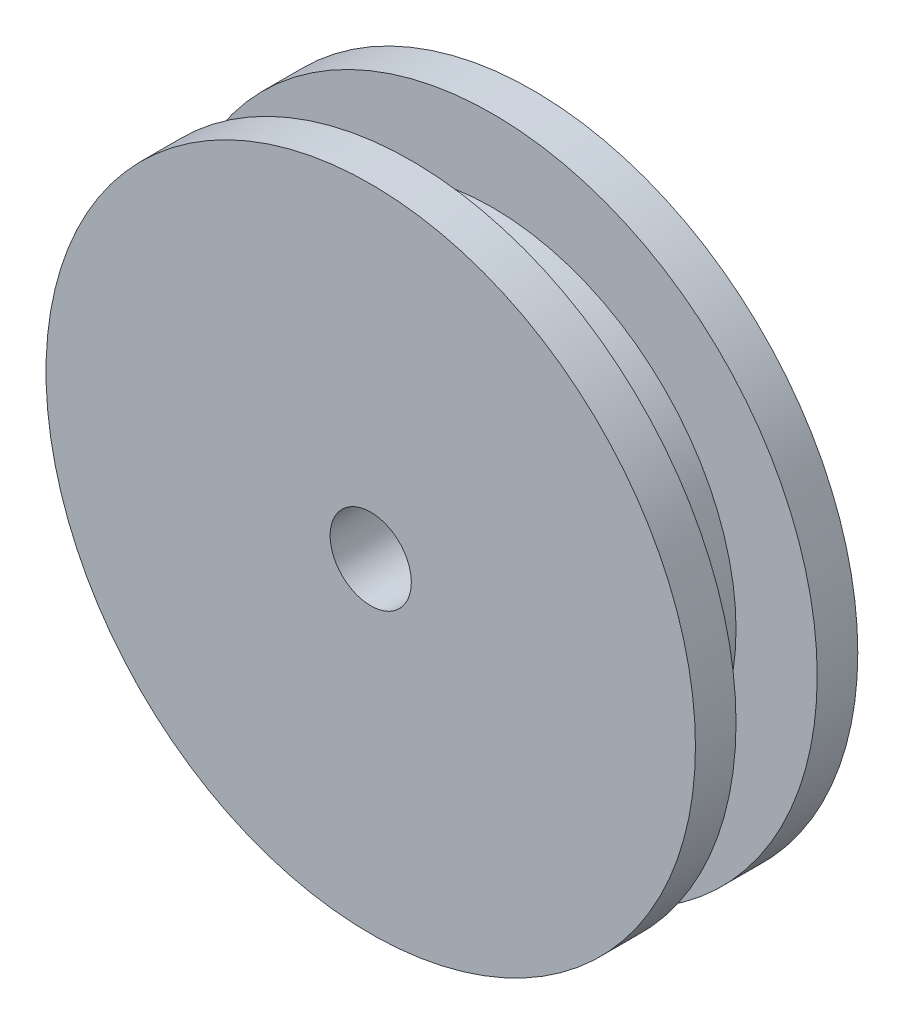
ISO-10303-21;
HEADER;
FILE_DESCRIPTION(('STEP AP214'),'2;1');
FILE_NAME('part.step','',(''),(''),'','','');
FILE_SCHEMA(('AUTOMOTIVE_DESIGN { 1 0 10303 214 1 1 1 1 }'));
ENDSEC;
DATA;
#1=APPLICATION_CONTEXT('core data for automotive mechanical design processes');
#2=APPLICATION_PROTOCOL_DEFINITION('international standard','automotive_design',2000,#1);
#3=PRODUCT_CONTEXT('',#1,'mechanical');
#4=PRODUCT('Part','Part','',(#3));
#5=PRODUCT_RELATED_PRODUCT_CATEGORY('part','',(#4));
#6=PRODUCT_DEFINITION_FORMATION('','',#4);
#7=PRODUCT_DEFINITION_CONTEXT('part definition',#1,'design');
#8=PRODUCT_DEFINITION('design','',#6,#7);
#9=PRODUCT_DEFINITION_SHAPE('','',#8);
#10=(LENGTH_UNIT() NAMED_UNIT(*) SI_UNIT(.MILLI.,.METRE.));
#11=(NAMED_UNIT(*) PLANE_ANGLE_UNIT() SI_UNIT($,.RADIAN.));
#12=(NAMED_UNIT(*) SI_UNIT($,.STERADIAN.) SOLID_ANGLE_UNIT());
#13=UNCERTAINTY_MEASURE_WITH_UNIT(LENGTH_MEASURE(1.E-05),#10,'distance_accuracy_value','');
#14=(GEOMETRIC_REPRESENTATION_CONTEXT(3) GLOBAL_UNCERTAINTY_ASSIGNED_CONTEXT((#13)) GLOBAL_UNIT_ASSIGNED_CONTEXT((#10,
#11,#12)) REPRESENTATION_CONTEXT('',''));
#15=CARTESIAN_POINT('',(0.,0.,0.));
#16=DIRECTION('',(0.,0.,1.));
#17=DIRECTION('',(1.,0.,0.));
#18=AXIS2_PLACEMENT_3D('',#15,#16,#17);
#19=CARTESIAN_POINT('',(0.,0.,6.35));
#20=DIRECTION('',(0.,0.,1.));
#21=DIRECTION('',(1.,0.,0.));
#22=AXIS2_PLACEMENT_3D('',#19,#20,#21);
#23=CYLINDRICAL_SURFACE('',#22,6.35);
#24=CARTESIAN_POINT('',(0.,0.,-6.35));
#25=DIRECTION('',(0.,0.,1.));
#26=DIRECTION('',(1.,0.,0.));
#27=AXIS2_PLACEMENT_3D('',#24,#25,#26);
#28=CIRCLE('',#27,6.35);
#29=CARTESIAN_POINT('',(6.35,0.,-6.35));
#30=VERTEX_POINT('',#29);
#31=EDGE_CURVE('E46',#30,#30,#28,.T.);
#32=ORIENTED_EDGE('',*,*,#31,.F.);
#33=EDGE_LOOP('',(#32));
#34=FACE_BOUND('',#33,.T.);
#35=CARTESIAN_POINT('',(0.,0.,-11.1125));
#36=DIRECTION('',(0.,0.,1.));
#37=DIRECTION('',(1.,0.,0.));
#38=AXIS2_PLACEMENT_3D('',#35,#36,#37);
#39=CIRCLE('',#38,6.35);
#40=CARTESIAN_POINT('',(6.35,0.,-11.1125));
#41=VERTEX_POINT('',#40);
#42=EDGE_CURVE('E10',#41,#41,#39,.T.);
#43=ORIENTED_EDGE('',*,*,#42,.T.);
#44=EDGE_LOOP('',(#43));
#45=FACE_BOUND('',#44,.T.);
#46=CARTESIAN_POINT('',(0.,6.35,-9.7234375));
#47=CARTESIAN_POINT('',(-0.0553700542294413,6.34999908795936,-9.72343523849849));
#48=CARTESIAN_POINT('',(-0.110771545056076,6.34926821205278,-9.71878687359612));
#49=CARTESIAN_POINT('',(-0.220024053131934,6.34642295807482,-9.70032203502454));
#50=CARTESIAN_POINT('',(-0.273873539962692,6.34430726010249,-9.68649681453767));
#51=CARTESIAN_POINT('',(-0.378425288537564,6.33892995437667,-9.65010307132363));
#52=CARTESIAN_POINT('',(-0.429129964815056,6.33566923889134,-9.62754135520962));
#53=CARTESIAN_POINT('',(-0.526026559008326,6.32836155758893,-9.57433213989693));
#54=CARTESIAN_POINT('',(-0.572219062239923,6.32431469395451,-9.54368569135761));
#55=CARTESIAN_POINT('',(-0.659177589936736,6.31584600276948,-9.47490125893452));
#56=CARTESIAN_POINT('',(-0.699899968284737,6.31142157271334,-9.43670841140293));
#57=CARTESIAN_POINT('',(-0.77438555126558,6.30271661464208,-9.35403341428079));
#58=CARTESIAN_POINT('',(-0.808148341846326,6.29843609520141,-9.30955089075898));
#59=CARTESIAN_POINT('',(-0.867928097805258,6.2904783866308,-9.21526356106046));
#60=CARTESIAN_POINT('',(-0.89390249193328,6.2868045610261,-9.16543145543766));
#61=CARTESIAN_POINT('',(-0.937096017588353,6.28051195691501,-9.06204475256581));
#62=CARTESIAN_POINT('',(-0.954315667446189,6.27789311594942,-9.00849037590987));
#63=CARTESIAN_POINT('',(-0.979374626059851,6.27403270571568,-8.89963973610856));
#64=CARTESIAN_POINT('',(-0.987288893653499,6.27278013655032,-8.84436112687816));
#65=CARTESIAN_POINT('',(-0.993744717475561,6.27176074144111,-8.73324739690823));
#66=CARTESIAN_POINT('',(-0.992286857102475,6.27199382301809,-8.67741231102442));
#67=CARTESIAN_POINT('',(-0.980100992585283,6.2739093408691,-8.56730211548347));
#68=CARTESIAN_POINT('',(-0.969456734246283,6.27557868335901,-8.51301747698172));
#69=CARTESIAN_POINT('',(-0.939331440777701,6.2801581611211,-8.40701423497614));
#70=CARTESIAN_POINT('',(-0.919850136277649,6.28306833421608,-8.35529570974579));
#71=CARTESIAN_POINT('',(-0.872517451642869,6.28981591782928,-8.25563947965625));
#72=CARTESIAN_POINT('',(-0.844630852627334,6.293657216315,-8.20771877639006));
#73=CARTESIAN_POINT('',(-0.781304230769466,6.3018314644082,-8.1172051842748));
#74=CARTESIAN_POINT('',(-0.745863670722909,6.30616444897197,-8.07461267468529));
#75=CARTESIAN_POINT('',(-0.667976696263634,6.31489158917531,-7.9954793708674));
#76=CARTESIAN_POINT('',(-0.62545833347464,6.31928589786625,-7.95900937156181));
#77=CARTESIAN_POINT('',(-0.534867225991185,6.32759690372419,-7.89371153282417));
#78=CARTESIAN_POINT('',(-0.486794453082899,6.33151359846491,-7.86488373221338));
#79=CARTESIAN_POINT('',(-0.386395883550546,6.33843267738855,-7.81568395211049));
#80=CARTESIAN_POINT('',(-0.334067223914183,6.3414344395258,-7.79531772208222));
#81=CARTESIAN_POINT('',(-0.226674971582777,6.34618031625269,-7.76368225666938));
#82=CARTESIAN_POINT('',(-0.171611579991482,6.34792452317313,-7.75241235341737));
#83=CARTESIAN_POINT('',(-0.0609236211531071,6.34994646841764,-7.73938425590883));
#84=CARTESIAN_POINT('',(-0.00531076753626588,6.35023920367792,-7.73752878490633));
#85=CARTESIAN_POINT('',(0.105431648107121,6.34936613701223,-7.74312360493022));
#86=CARTESIAN_POINT('',(0.160561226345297,6.34820038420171,-7.75057358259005));
#87=CARTESIAN_POINT('',(0.268475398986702,6.34455060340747,-7.77448692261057));
#88=CARTESIAN_POINT('',(0.321270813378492,6.34207354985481,-7.79090261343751));
#89=CARTESIAN_POINT('',(0.423360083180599,6.33607792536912,-7.83223092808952));
#90=CARTESIAN_POINT('',(0.472653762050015,6.33255930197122,-7.85714397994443));
#91=CARTESIAN_POINT('',(0.566766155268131,6.32483404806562,-7.91498607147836));
#92=CARTESIAN_POINT('',(0.611546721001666,6.32062223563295,-7.94797647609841));
#93=CARTESIAN_POINT('',(0.694970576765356,6.31199477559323,-8.02095173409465));
#94=CARTESIAN_POINT('',(0.733613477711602,6.30757911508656,-8.06093703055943));
#95=CARTESIAN_POINT('',(0.804021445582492,6.29899373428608,-8.14720128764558));
#96=CARTESIAN_POINT('',(0.835721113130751,6.294826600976,-8.19353392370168));
#97=CARTESIAN_POINT('',(0.890887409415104,6.28725681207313,-8.29092356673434));
#98=CARTESIAN_POINT('',(0.914354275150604,6.2838541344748,-8.34198043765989));
#99=CARTESIAN_POINT('',(0.952288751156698,6.27821750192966,-8.44717863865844));
#100=CARTESIAN_POINT('',(0.966790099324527,6.27597917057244,-8.50130755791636));
#101=CARTESIAN_POINT('',(0.986488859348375,6.2729132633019,-8.61127037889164));
#102=CARTESIAN_POINT('',(0.991686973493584,6.27208558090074,-8.66710415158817));
#103=CARTESIAN_POINT('',(0.992613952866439,6.27193888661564,-8.77823949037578));
#104=CARTESIAN_POINT('',(0.988445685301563,6.27260348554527,-8.83354020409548));
#105=CARTESIAN_POINT('',(0.970979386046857,6.27533074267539,-8.94264360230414));
#106=CARTESIAN_POINT('',(0.957681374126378,6.27739339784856,-8.99644629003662));
#107=CARTESIAN_POINT('',(0.922370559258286,6.28267844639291,-9.10099376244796));
#108=CARTESIAN_POINT('',(0.900365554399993,6.28589980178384,-9.15174123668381));
#109=CARTESIAN_POINT('',(0.848275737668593,6.2931404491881,-9.24884072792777));
#110=CARTESIAN_POINT('',(0.818190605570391,6.29715977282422,-9.29519257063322));
#111=CARTESIAN_POINT('',(0.750423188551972,6.30559591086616,-9.38270663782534));
#112=CARTESIAN_POINT('',(0.712664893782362,6.3100164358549,-9.42380965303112));
#113=CARTESIAN_POINT('',(0.630783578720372,6.31872642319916,-9.49913217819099));
#114=CARTESIAN_POINT('',(0.586659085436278,6.32301585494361,-9.53335009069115));
#115=CARTESIAN_POINT('',(0.49298497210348,6.33100993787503,-9.59411626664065));
#116=CARTESIAN_POINT('',(0.443404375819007,6.33471092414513,-9.62061725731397));
#117=CARTESIAN_POINT('',(0.340459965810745,6.34107531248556,-9.66487502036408));
#118=CARTESIAN_POINT('',(0.287100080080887,6.34373977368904,-9.68264072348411));
#119=CARTESIAN_POINT('',(0.194593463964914,6.34713236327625,-9.70495623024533));
#120=CARTESIAN_POINT('',(0.156013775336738,6.34820212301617,-9.71187593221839));
#121=CARTESIAN_POINT('',(0.0782946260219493,6.34963625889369,-9.72111733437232));
#122=CARTESIAN_POINT('',(0.0391551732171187,6.35000064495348,-9.72343909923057));
#123=CARTESIAN_POINT('',(0.,6.35,-9.7234375));
#124=B_SPLINE_CURVE_WITH_KNOTS('',3,(#46,#47,#48,#49,#50,#51,#52,#53,#54,#55,#56,#57,#58,#59,
#60,#61,#62,#63,#64,#65,#66,#67,#68,#69,#70,#71,#72,#73,#74,#75,#76,#77,#78,#79,#80,#81,#82,#83,
#84,#85,#86,#87,#88,#89,#90,#91,#92,#93,#94,#95,#96,#97,#98,#99,#100,#101,#102,#103,#104,#105,
#106,#107,#108,#109,#110,#111,#112,#113,#114,#115,#116,#117,#118,#119,#120,#121,#122,#123),
.UNSPECIFIED.,.T.,.F.,(4,2,2,2,2,2,2,2,2,2,2,2,2,2,2,2,2,2,2,2,2,2,2,2,2,2,2,2,2,2,2,2,2,2,2,2,
2,2,4),(0.,0.165967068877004,0.332092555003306,0.498088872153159,0.66406362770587,
0.831292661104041,0.998531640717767,1.16666874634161,1.33479589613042,1.50155922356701,
1.66831217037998,1.83356081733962,1.99881450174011,2.16477047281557,2.33073824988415,
2.49850962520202,2.666281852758,2.83416789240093,3.00204160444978,3.16817713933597,
3.33430707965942,3.49956217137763,3.66482558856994,3.83138577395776,3.99795651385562,
4.16603449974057,4.3341076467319,4.50154441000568,4.66896853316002,4.83456290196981,
5.00015691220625,5.16560294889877,5.33105554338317,5.49823486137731,5.66545292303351,
5.83367476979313,6.00172427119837,6.11909025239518,6.23645458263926),.UNSPECIFIED.);
#125=CARTESIAN_POINT('',(0.,6.35,-9.7234375));
#126=VERTEX_POINT('',#125);
#127=EDGE_CURVE('E74',#126,#126,#124,.T.);
#128=ORIENTED_EDGE('',*,*,#127,.F.);
#129=EDGE_LOOP('',(#128));
#130=FACE_BOUND('',#129,.T.);
#131=ADVANCED_FACE('F33',(#34,#45,#130),#23,.T.);
#132=CARTESIAN_POINT('',(0.,0.,-11.1125));
#133=DIRECTION('',(0.,0.,1.));
#134=DIRECTION('',(1.,0.,0.));
#135=AXIS2_PLACEMENT_3D('',#132,#133,#134);
#136=CYLINDRICAL_SURFACE('',#135,3.175);
#137=CARTESIAN_POINT('',(0.,0.,-11.1125));
#138=DIRECTION('',(0.,0.,1.));
#139=DIRECTION('',(1.,0.,0.));
#140=AXIS2_PLACEMENT_3D('',#137,#138,#139);
#141=CIRCLE('',#140,3.175);
#142=CARTESIAN_POINT('',(3.175,0.,-11.1125));
#143=VERTEX_POINT('',#142);
#144=EDGE_CURVE('E70',#143,#143,#141,.T.);
#145=ORIENTED_EDGE('',*,*,#144,.F.);
#146=EDGE_LOOP('',(#145));
#147=FACE_BOUND('',#146,.T.);
#148=CARTESIAN_POINT('',(0.,0.,6.35));
#149=DIRECTION('',(0.,0.,1.));
#150=DIRECTION('',(1.,0.,0.));
#151=AXIS2_PLACEMENT_3D('',#148,#149,#150);
#152=CIRCLE('',#151,3.175);
#153=CARTESIAN_POINT('',(3.175,0.,6.35));
#154=VERTEX_POINT('',#153);
#155=EDGE_CURVE('E71',#154,#154,#152,.T.);
#156=ORIENTED_EDGE('',*,*,#155,.T.);
#157=EDGE_LOOP('',(#156));
#158=FACE_BOUND('',#157,.T.);
#159=CARTESIAN_POINT('',(0.,3.175,-9.7234375));
#160=CARTESIAN_POINT('',(0.0543236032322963,3.17499972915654,-9.72343714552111));
#161=CARTESIAN_POINT('',(0.108650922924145,3.17359264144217,-9.71896136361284));
#162=CARTESIAN_POINT('',(0.215716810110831,3.1681173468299,-9.70122342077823));
#163=CARTESIAN_POINT('',(0.268455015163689,3.16404853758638,-9.68795927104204));
#164=CARTESIAN_POINT('',(0.370783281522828,3.15369428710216,-9.65313556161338));
#165=CARTESIAN_POINT('',(0.420378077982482,3.14741227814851,-9.63158884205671));
#166=CARTESIAN_POINT('',(0.515250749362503,3.13328025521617,-9.58086625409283));
#167=CARTESIAN_POINT('',(0.560527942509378,3.1254299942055,-9.55168918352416));
#168=CARTESIAN_POINT('',(0.646878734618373,3.10872357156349,-9.48558555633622));
#169=CARTESIAN_POINT('',(0.687800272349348,3.09984549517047,-9.44846592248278));
#170=CARTESIAN_POINT('',(0.762950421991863,3.08221099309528,-9.36794196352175));
#171=CARTESIAN_POINT('',(0.797177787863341,3.07345459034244,-9.3245364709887));
#172=CARTESIAN_POINT('',(0.858792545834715,3.05681971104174,-9.23135650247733));
#173=CARTESIAN_POINT('',(0.885989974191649,3.0489682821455,-9.18145112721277));
#174=CARTESIAN_POINT('',(0.931542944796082,3.03536192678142,-9.07748984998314));
#175=CARTESIAN_POINT('',(0.949900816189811,3.02960644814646,-9.02343504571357));
#176=CARTESIAN_POINT('',(0.976697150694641,3.02107288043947,-8.91442521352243));
#177=CARTESIAN_POINT('',(0.985417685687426,3.01821034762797,-8.85954631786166));
#178=CARTESIAN_POINT('',(0.993573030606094,3.01553606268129,-8.74903546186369));
#179=CARTESIAN_POINT('',(0.993010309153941,3.01572349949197,-8.69340370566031));
#180=CARTESIAN_POINT('',(0.982835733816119,3.01905343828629,-8.5852996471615));
#181=CARTESIAN_POINT('',(0.973582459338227,3.02207883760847,-8.53278938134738));
#182=CARTESIAN_POINT('',(0.946870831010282,3.03055357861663,-8.43010747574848));
#183=CARTESIAN_POINT('',(0.92941160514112,3.03600317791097,-8.37993608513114));
#184=CARTESIAN_POINT('',(0.886530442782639,3.04880203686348,-8.2825018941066));
#185=CARTESIAN_POINT('',(0.860995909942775,3.05617788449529,-8.23529229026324));
#186=CARTESIAN_POINT('',(0.802767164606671,3.0719859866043,-8.14571033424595));
#187=CARTESIAN_POINT('',(0.77007109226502,3.08041851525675,-8.10333924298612));
#188=CARTESIAN_POINT('',(0.696687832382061,3.09785962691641,-8.02260988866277));
#189=CARTESIAN_POINT('',(0.655704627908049,3.10687695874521,-7.98452210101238));
#190=CARTESIAN_POINT('',(0.567820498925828,3.12413309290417,-7.91569418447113));
#191=CARTESIAN_POINT('',(0.520919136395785,3.13237183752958,-7.88495459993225));
#192=CARTESIAN_POINT('',(0.422008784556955,3.14722902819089,-7.83151239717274));
#193=CARTESIAN_POINT('',(0.369962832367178,3.15383434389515,-7.80887429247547));
#194=CARTESIAN_POINT('',(0.262547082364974,3.16458564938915,-7.77275480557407));
#195=CARTESIAN_POINT('',(0.207178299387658,3.16873238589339,-7.75927064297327));
#196=CARTESIAN_POINT('',(0.0969844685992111,3.17397915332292,-7.74230255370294));
#197=CARTESIAN_POINT('',(0.0422210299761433,3.17519068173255,-7.73845246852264));
#198=CARTESIAN_POINT('',(-0.0671753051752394,3.17476028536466,-7.73982944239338));
#199=CARTESIAN_POINT('',(-0.121808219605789,3.17311877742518,-7.74505517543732));
#200=CARTESIAN_POINT('',(-0.227980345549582,3.16724001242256,-7.76414150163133));
#201=CARTESIAN_POINT('',(-0.279562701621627,3.16306829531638,-7.77778421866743));
#202=CARTESIAN_POINT('',(-0.379691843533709,3.15261721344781,-7.81305139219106));
#203=CARTESIAN_POINT('',(-0.428238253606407,3.14633758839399,-7.83467683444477));
#204=CARTESIAN_POINT('',(-0.522233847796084,3.13212593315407,-7.88588499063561));
#205=CARTESIAN_POINT('',(-0.567578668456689,3.12415735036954,-7.91564884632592));
#206=CARTESIAN_POINT('',(-0.652752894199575,3.10747894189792,-7.98207161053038));
#207=CARTESIAN_POINT('',(-0.692580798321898,3.09876891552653,-8.0187323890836));
#208=CARTESIAN_POINT('',(-0.767228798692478,3.08115489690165,-8.09963049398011));
#209=CARTESIAN_POINT('',(-0.801787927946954,3.07225689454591,-8.1441104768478));
#210=CARTESIAN_POINT('',(-0.862974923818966,3.05563545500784,-8.23843175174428));
#211=CARTESIAN_POINT('',(-0.889602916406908,3.04791199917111,-8.28827295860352));
#212=CARTESIAN_POINT('',(-0.934006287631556,3.03459977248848,-8.39179898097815));
#213=CARTESIAN_POINT('',(-0.951815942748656,3.02900275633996,-8.44546797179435));
#214=CARTESIAN_POINT('',(-0.97808172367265,3.02062491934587,-8.55525379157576));
#215=CARTESIAN_POINT('',(-0.986541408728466,3.01784302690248,-8.61136968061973));
#216=CARTESIAN_POINT('',(-0.993611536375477,3.01552207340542,-8.72172824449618));
#217=CARTESIAN_POINT('',(-0.992650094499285,3.01584204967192,-8.77594086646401));
#218=CARTESIAN_POINT('',(-0.9819387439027,3.01934634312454,-8.8833917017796));
#219=CARTESIAN_POINT('',(-0.972189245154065,3.02253052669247,-8.93662996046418));
#220=CARTESIAN_POINT('',(-0.944465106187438,3.03130596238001,-9.03985526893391));
#221=CARTESIAN_POINT('',(-0.926612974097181,3.03686129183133,-9.08987850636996));
#222=CARTESIAN_POINT('',(-0.88328680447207,3.04974390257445,-9.18625957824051));
#223=CARTESIAN_POINT('',(-0.85781121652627,3.05707154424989,-9.23261666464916));
#224=CARTESIAN_POINT('',(-0.798795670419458,3.07303080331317,-9.3223127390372));
#225=CARTESIAN_POINT('',(-0.764979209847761,3.08170221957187,-9.36546270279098));
#226=CARTESIAN_POINT('',(-0.690728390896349,3.09918892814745,-9.44561414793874));
#227=CARTESIAN_POINT('',(-0.65029226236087,3.10800425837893,-9.48261397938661));
#228=CARTESIAN_POINT('',(-0.56236128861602,3.12513084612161,-9.55062426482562));
#229=CARTESIAN_POINT('',(-0.514679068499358,3.13341624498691,-9.58139969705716));
#230=CARTESIAN_POINT('',(-0.414559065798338,3.14822498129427,-9.63445726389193));
#231=CARTESIAN_POINT('',(-0.362123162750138,3.15474901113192,-9.65674273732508));
#232=CARTESIAN_POINT('',(-0.258562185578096,3.16484516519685,-9.69056939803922));
#233=CARTESIAN_POINT('',(-0.207700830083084,3.16862016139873,-9.70285942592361));
#234=CARTESIAN_POINT('',(-0.104560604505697,3.17369745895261,-9.71929282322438));
#235=CARTESIAN_POINT('',(-0.0522820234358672,3.17500026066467,-9.72343784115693));
#236=CARTESIAN_POINT('',(0.,3.175,-9.7234375));
#237=B_SPLINE_CURVE_WITH_KNOTS('',3,(#159,#160,#161,#162,#163,#164,#165,#166,#167,#168,#169,
#170,#171,#172,#173,#174,#175,#176,#177,#178,#179,#180,#181,#182,#183,#184,#185,#186,#187,#188,
#189,#190,#191,#192,#193,#194,#195,#196,#197,#198,#199,#200,#201,#202,#203,#204,#205,#206,#207,
#208,#209,#210,#211,#212,#213,#214,#215,#216,#217,#218,#219,#220,#221,#222,#223,#224,#225,#226,
#227,#228,#229,#230,#231,#232,#233,#234,#235,#236),.UNSPECIFIED.,.T.,.F.,(4,2,2,2,2,2,2,2,2,2,2,
2,2,2,2,2,2,2,2,2,2,2,2,2,2,2,2,2,2,2,2,2,2,2,2,2,2,2,4),(0.,0.162778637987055,
0.325594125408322,0.488158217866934,0.650747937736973,0.817862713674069,0.985008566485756,
1.15628555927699,1.32751739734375,1.49359262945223,1.65962369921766,1.81909178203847,
1.97857681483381,2.14039166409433,2.30224858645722,2.47147355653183,2.6407110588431,
2.81126771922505,2.98177255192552,3.14569132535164,3.30958615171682,3.4694068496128,
3.62924728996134,3.7929845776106,3.95676632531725,4.12703786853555,4.29730670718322,
4.46690841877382,4.63644554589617,4.79831561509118,4.96017813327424,5.11967093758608,
5.27919620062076,5.4449623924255,5.6107729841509,5.78199780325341,5.95315521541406,
6.10984805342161,6.2665091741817),.UNSPECIFIED.);
#238=CARTESIAN_POINT('',(0.,3.175,-9.7234375));
#239=VERTEX_POINT('',#238);
#240=EDGE_CURVE('E37',#239,#239,#237,.T.);
#241=ORIENTED_EDGE('',*,*,#240,.F.);
#242=EDGE_LOOP('',(#241));
#243=FACE_BOUND('',#242,.T.);
#244=ADVANCED_FACE('F89',(#147,#158,#243),#136,.F.);
#245=CARTESIAN_POINT('',(0.,25.4,6.35));
#246=DIRECTION('',(0.,0.,-1.));
#247=DIRECTION('',(-1.,0.,0.));
#248=AXIS2_PLACEMENT_3D('',#245,#246,#247);
#249=PLANE('',#248);
#250=ORIENTED_EDGE('',*,*,#155,.F.);
#251=EDGE_LOOP('',(#250));
#252=FACE_BOUND('',#251,.T.);
#253=CARTESIAN_POINT('',(0.,0.,6.35));
#254=DIRECTION('',(0.,0.,1.));
#255=DIRECTION('',(1.,0.,0.));
#256=AXIS2_PLACEMENT_3D('',#253,#254,#255);
#257=CIRCLE('',#256,25.4);
#258=CARTESIAN_POINT('',(25.4,0.,6.35));
#259=VERTEX_POINT('',#258);
#260=EDGE_CURVE('E67',#259,#259,#257,.T.);
#261=ORIENTED_EDGE('',*,*,#260,.T.);
#262=EDGE_LOOP('',(#261));
#263=FACE_BOUND('',#262,.T.);
#264=ADVANCED_FACE('F35',(#252,#263),#249,.F.);
#265=CARTESIAN_POINT('',(0.,6.35,-11.1125));
#266=DIRECTION('',(0.,0.,1.));
#267=DIRECTION('',(1.,0.,0.));
#268=AXIS2_PLACEMENT_3D('',#265,#266,#267);
#269=PLANE('',#268);
#270=ORIENTED_EDGE('',*,*,#144,.T.);
#271=EDGE_LOOP('',(#270));
#272=FACE_BOUND('',#271,.T.);
#273=ORIENTED_EDGE('',*,*,#42,.F.);
#274=EDGE_LOOP('',(#273));
#275=FACE_BOUND('',#274,.T.);
#276=ADVANCED_FACE('F115',(#272,#275),#269,.F.);
#277=CARTESIAN_POINT('',(0.,6.35,-6.35));
#278=DIRECTION('',(0.,0.,1.));
#279=DIRECTION('',(1.,0.,0.));
#280=AXIS2_PLACEMENT_3D('',#277,#278,#279);
#281=PLANE('',#280);
#282=CARTESIAN_POINT('',(0.,0.,-6.35));
#283=DIRECTION('',(0.,0.,1.));
#284=DIRECTION('',(1.,0.,0.));
#285=AXIS2_PLACEMENT_3D('',#282,#283,#284);
#286=CIRCLE('',#285,25.4);
#287=CARTESIAN_POINT('',(25.4,0.,-6.35));
#288=VERTEX_POINT('',#287);
#289=EDGE_CURVE('E50',#288,#288,#286,.T.);
#290=ORIENTED_EDGE('',*,*,#289,.F.);
#291=EDGE_LOOP('',(#290));
#292=FACE_BOUND('',#291,.T.);
#293=ORIENTED_EDGE('',*,*,#31,.T.);
#294=EDGE_LOOP('',(#293));
#295=FACE_BOUND('',#294,.T.);
#296=ADVANCED_FACE('F112',(#292,#295),#281,.F.);
#297=CARTESIAN_POINT('',(0.,0.,6.35));
#298=DIRECTION('',(0.,0.,1.));
#299=DIRECTION('',(1.,0.,0.));
#300=AXIS2_PLACEMENT_3D('',#297,#298,#299);
#301=CYLINDRICAL_SURFACE('',#300,25.4);
#302=CARTESIAN_POINT('',(0.,0.,-3.175));
#303=DIRECTION('',(0.,0.,1.));
#304=DIRECTION('',(1.,0.,0.));
#305=AXIS2_PLACEMENT_3D('',#302,#303,#304);
#306=CIRCLE('',#305,25.4);
#307=CARTESIAN_POINT('',(25.4,0.,-3.175));
#308=VERTEX_POINT('',#307);
#309=EDGE_CURVE('E55',#308,#308,#306,.T.);
#310=ORIENTED_EDGE('',*,*,#309,.F.);
#311=EDGE_LOOP('',(#310));
#312=FACE_BOUND('',#311,.T.);
#313=ORIENTED_EDGE('',*,*,#289,.T.);
#314=EDGE_LOOP('',(#313));
#315=FACE_BOUND('',#314,.T.);
#316=ADVANCED_FACE('F109',(#312,#315),#301,.T.);
#317=CARTESIAN_POINT('',(0.,25.4,-3.175));
#318=DIRECTION('',(0.,0.,-1.));
#319=DIRECTION('',(-1.,0.,0.));
#320=AXIS2_PLACEMENT_3D('',#317,#318,#319);
#321=PLANE('',#320);
#322=CARTESIAN_POINT('',(0.,0.,-3.175));
#323=DIRECTION('',(0.,0.,1.));
#324=DIRECTION('',(1.,0.,0.));
#325=AXIS2_PLACEMENT_3D('',#322,#323,#324);
#326=CIRCLE('',#325,19.05);
#327=CARTESIAN_POINT('',(19.05,0.,-3.175));
#328=VERTEX_POINT('',#327);
#329=EDGE_CURVE('E58',#328,#328,#326,.T.);
#330=ORIENTED_EDGE('',*,*,#329,.F.);
#331=EDGE_LOOP('',(#330));
#332=FACE_BOUND('',#331,.T.);
#333=ORIENTED_EDGE('',*,*,#309,.T.);
#334=EDGE_LOOP('',(#333));
#335=FACE_BOUND('',#334,.T.);
#336=ADVANCED_FACE('F105',(#332,#335),#321,.F.);
#337=CARTESIAN_POINT('',(0.,0.,6.35));
#338=DIRECTION('',(0.,0.,1.));
#339=DIRECTION('',(1.,0.,0.));
#340=AXIS2_PLACEMENT_3D('',#337,#338,#339);
#341=CYLINDRICAL_SURFACE('',#340,19.05);
#342=CARTESIAN_POINT('',(0.,0.,3.175));
#343=DIRECTION('',(0.,0.,1.));
#344=DIRECTION('',(1.,0.,0.));
#345=AXIS2_PLACEMENT_3D('',#342,#343,#344);
#346=CIRCLE('',#345,19.05);
#347=CARTESIAN_POINT('',(19.05,0.,3.175));
#348=VERTEX_POINT('',#347);
#349=EDGE_CURVE('E61',#348,#348,#346,.T.);
#350=ORIENTED_EDGE('',*,*,#349,.F.);
#351=EDGE_LOOP('',(#350));
#352=FACE_BOUND('',#351,.T.);
#353=ORIENTED_EDGE('',*,*,#329,.T.);
#354=EDGE_LOOP('',(#353));
#355=FACE_BOUND('',#354,.T.);
#356=ADVANCED_FACE('F101',(#352,#355),#341,.T.);
#357=CARTESIAN_POINT('',(0.,19.05,3.175));
#358=DIRECTION('',(0.,0.,1.));
#359=DIRECTION('',(1.,0.,0.));
#360=AXIS2_PLACEMENT_3D('',#357,#358,#359);
#361=PLANE('',#360);
#362=CARTESIAN_POINT('',(0.,0.,3.175));
#363=DIRECTION('',(0.,0.,1.));
#364=DIRECTION('',(1.,0.,0.));
#365=AXIS2_PLACEMENT_3D('',#362,#363,#364);
#366=CIRCLE('',#365,25.4);
#367=CARTESIAN_POINT('',(25.4,0.,3.175));
#368=VERTEX_POINT('',#367);
#369=EDGE_CURVE('E64',#368,#368,#366,.T.);
#370=ORIENTED_EDGE('',*,*,#369,.F.);
#371=EDGE_LOOP('',(#370));
#372=FACE_BOUND('',#371,.T.);
#373=ORIENTED_EDGE('',*,*,#349,.T.);
#374=EDGE_LOOP('',(#373));
#375=FACE_BOUND('',#374,.T.);
#376=ADVANCED_FACE('F97',(#372,#375),#361,.F.);
#377=CARTESIAN_POINT('',(0.,0.,6.35));
#378=DIRECTION('',(0.,0.,1.));
#379=DIRECTION('',(1.,0.,0.));
#380=AXIS2_PLACEMENT_3D('',#377,#378,#379);
#381=CYLINDRICAL_SURFACE('',#380,25.4);
#382=ORIENTED_EDGE('',*,*,#260,.F.);
#383=EDGE_LOOP('',(#382));
#384=FACE_BOUND('',#383,.T.);
#385=ORIENTED_EDGE('',*,*,#369,.T.);
#386=EDGE_LOOP('',(#385));
#387=FACE_BOUND('',#386,.T.);
#388=ADVANCED_FACE('F87',(#384,#387),#381,.T.);
#389=CARTESIAN_POINT('',(0.,25.4,-8.73125));
#390=DIRECTION('',(0.,-1.,0.));
#391=DIRECTION('',(0.,0.,-1.));
#392=AXIS2_PLACEMENT_3D('',#389,#390,#391);
#393=CYLINDRICAL_SURFACE('',#392,0.992187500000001);
#394=ORIENTED_EDGE('',*,*,#240,.T.);
#395=EDGE_LOOP('',(#394));
#396=FACE_BOUND('',#395,.T.);
#397=ORIENTED_EDGE('',*,*,#127,.T.);
#398=EDGE_LOOP('',(#397));
#399=FACE_BOUND('',#398,.T.);
#400=ADVANCED_FACE('F84',(#396,#399),#393,.F.);
#401=CLOSED_SHELL('',(#131,#244,#264,#276,#296,#316,#336,#356,#376,#388,#400));
#402=MANIFOLD_SOLID_BREP('B2',#401);
#403=ADVANCED_BREP_SHAPE_REPRESENTATION('',(#18,#402),#14);
#404=SHAPE_DEFINITION_REPRESENTATION(#9,#403);
ENDSEC;
END-ISO-10303-21;
